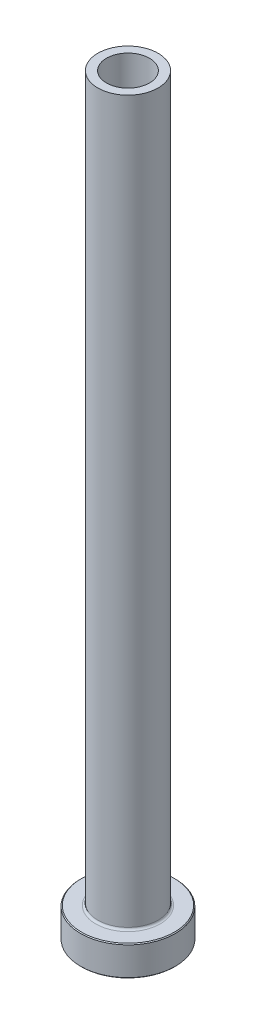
from build123d import *

# Parameters (mm, degrees)
FILLET1_R     = 0.5
CHAMFER1_SIZE = 0.2
CHAMFER3_SIZE = 0.5


with BuildPart() as part:
    # Sketch1 → Revolve1 (revolve)
    with BuildSketch(Plane.XY, mode=Mode.PRIVATE) as revolve1_sk:
        Polygon((-5, 175), (-7, 175), (-7, 7), (-11, 7), (-11, 0), (-5.25, 0), (-5.25, 118), (-5, 130), align=None)
    revolve(revolve1_sk.sketch.rotate(Axis((0, 92.187680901, 0), (0, -1, 0)), 270), axis=Axis((0, 92.187680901, 0), (0, -1, 0)))

    # Fillet1
    fillet1_edges = [part.edges().sort_by_distance(p)[0] for p in [
        (0, 7, -7),
    ]]
    fillet(fillet1_edges, radius=FILLET1_R)

    # Chamfer1
    chamfer1_edges = [part.edges().sort_by_distance(p)[0] for p in [
        (0, 0, -11),
        (0, 7, -11),
    ]]
    chamfer(chamfer1_edges, length=CHAMFER1_SIZE)

    # Chamfer3
    chamfer3_edges = [part.edges().sort_by_distance(p)[0] for p in [
        (0, 0, -5.25),
    ]]
    chamfer(chamfer3_edges, length=CHAMFER3_SIZE)


solid = part.part
